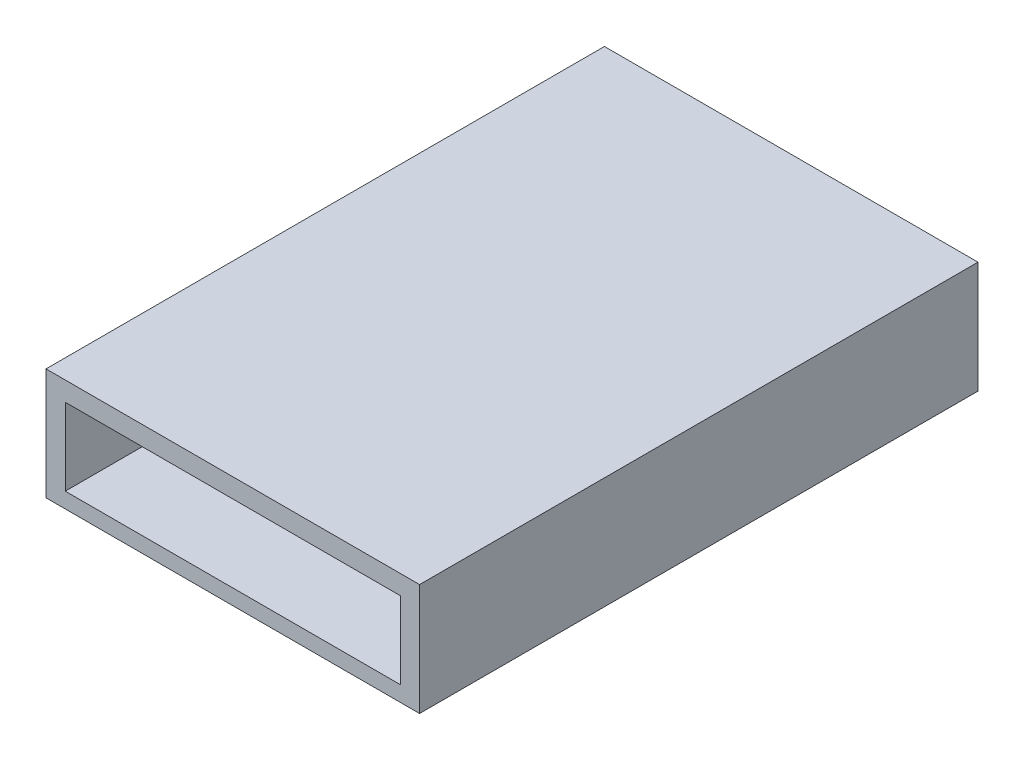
from build123d import *

# Parameters (mm, degrees)
SKETCH1_W           = 19.4
SKETCH1_H           = 5.8
BOSS_EXTRUDE1_DEPTH = 29
SKETCH2_W           = 17.4
SKETCH2_H           = 4
CUT_EXTRUDE1_DEPTH  = 28
SKETCH4_R           = 2.425
CUT_EXTRUDE3_DEPTH  = 0.8
CUT_EXTRUDE2_DEPTH  = 28


with BuildPart() as part:
    # Sketch1 → Boss-Extrude1 (new body)
    with BuildSketch(Plane.XY):
        with Locations((9.7, 2.9)):
            Rectangle(SKETCH1_W, SKETCH1_H)
    extrude(amount=BOSS_EXTRUDE1_DEPTH)

    # Sketch2 → Cut-Extrude1 (cut)
    with BuildSketch(Plane.XY.offset(29)):
        with Locations((9.7, 2.8)):
            Rectangle(SKETCH2_W, SKETCH2_H)
    extrude(amount=-CUT_EXTRUDE1_DEPTH, mode=Mode.SUBTRACT)

    # Sketch4 → Cut-Extrude3 (cut)
    with BuildSketch(Plane.XZ):
        with Locations(Location((15.375, 22.765, 0), (0, 0, 270))):
            Circle(SKETCH4_R)
        with Locations(Location((7.405, 6.825, 0), (0, 0, 270))):
            Circle(SKETCH4_R)
    extrude(amount=-CUT_EXTRUDE3_DEPTH, mode=Mode.SUBTRACT)

    # Sketch3 → Cut-Extrude2 (cut)
    with BuildSketch(Plane.XY.offset(1)):
        Polygon((5.7, 4.7), (13.7, 4.7), (13.7, 3.3), (12.5, 1.9), (6.9, 1.9), (5.7, 3.3), align=None)
    extrude(amount=-CUT_EXTRUDE2_DEPTH, mode=Mode.SUBTRACT)


solid = part.part
